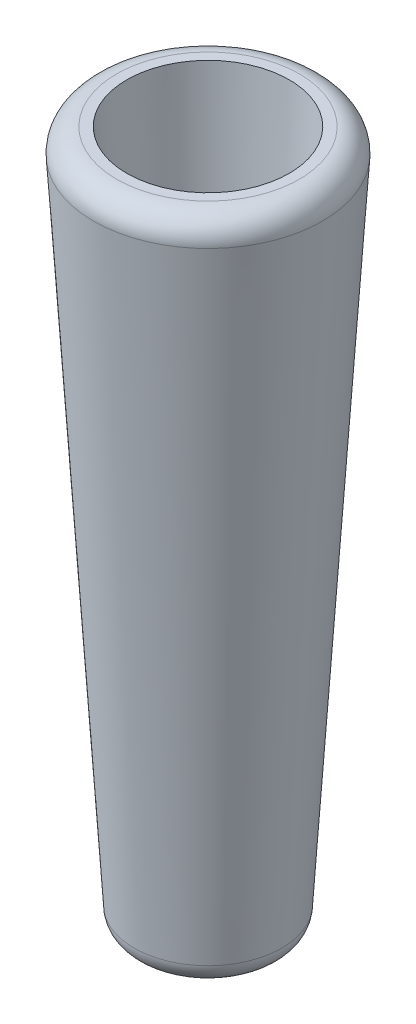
ISO-10303-21;
HEADER;
FILE_DESCRIPTION(('STEP AP214'),'2;1');
FILE_NAME('part.step','',(''),(''),'','','');
FILE_SCHEMA(('AUTOMOTIVE_DESIGN { 1 0 10303 214 1 1 1 1 }'));
ENDSEC;
DATA;
#1=APPLICATION_CONTEXT('core data for automotive mechanical design processes');
#2=APPLICATION_PROTOCOL_DEFINITION('international standard','automotive_design',2000,#1);
#3=PRODUCT_CONTEXT('',#1,'mechanical');
#4=PRODUCT('Part','Part','',(#3));
#5=PRODUCT_RELATED_PRODUCT_CATEGORY('part','',(#4));
#6=PRODUCT_DEFINITION_FORMATION('','',#4);
#7=PRODUCT_DEFINITION_CONTEXT('part definition',#1,'design');
#8=PRODUCT_DEFINITION('design','',#6,#7);
#9=PRODUCT_DEFINITION_SHAPE('','',#8);
#10=(LENGTH_UNIT() NAMED_UNIT(*) SI_UNIT(.MILLI.,.METRE.));
#11=(NAMED_UNIT(*) PLANE_ANGLE_UNIT() SI_UNIT($,.RADIAN.));
#12=(NAMED_UNIT(*) SI_UNIT($,.STERADIAN.) SOLID_ANGLE_UNIT());
#13=UNCERTAINTY_MEASURE_WITH_UNIT(LENGTH_MEASURE(1.E-05),#10,'distance_accuracy_value','');
#14=(GEOMETRIC_REPRESENTATION_CONTEXT(3) GLOBAL_UNCERTAINTY_ASSIGNED_CONTEXT((#13)) GLOBAL_UNIT_ASSIGNED_CONTEXT((#10,
#11,#12)) REPRESENTATION_CONTEXT('',''));
#15=CARTESIAN_POINT('',(0.,0.,0.));
#16=DIRECTION('',(0.,0.,1.));
#17=DIRECTION('',(1.,0.,0.));
#18=AXIS2_PLACEMENT_3D('',#15,#16,#17);
#19=CARTESIAN_POINT('',(0.,-40.,0.));
#20=DIRECTION('',(0.,1.,0.));
#21=DIRECTION('',(0.,0.,1.));
#22=AXIS2_PLACEMENT_3D('',#19,#20,#21);
#23=CONICAL_SURFACE('',#22,2.5,0.0624188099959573);
#24=CARTESIAN_POINT('',(0.,-1.06237828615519,0.));
#25=DIRECTION('',(0.,-1.,0.));
#26=DIRECTION('',(0.,0.,-1.));
#27=AXIS2_PLACEMENT_3D('',#24,#25,#26);
#28=CIRCLE('',#27,4.9336013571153);
#29=CARTESIAN_POINT('',(0.,-1.06237828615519,-4.9336013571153));
#30=VERTEX_POINT('',#29);
#31=EDGE_CURVE('E48',#30,#30,#28,.T.);
#32=ORIENTED_EDGE('',*,*,#31,.T.);
#33=EDGE_LOOP('',(#32));
#34=FACE_BOUND('',#33,.T.);
#35=CARTESIAN_POINT('',(0.,-29.0623782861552,0.));
#36=DIRECTION('',(0.,-1.,0.));
#37=DIRECTION('',(0.,0.,-1.));
#38=AXIS2_PLACEMENT_3D('',#35,#36,#37);
#39=CIRCLE('',#38,3.1836013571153);
#40=CARTESIAN_POINT('',(0.,-29.0623782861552,-3.1836013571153));
#41=VERTEX_POINT('',#40);
#42=EDGE_CURVE('E52',#41,#41,#39,.F.);
#43=ORIENTED_EDGE('',*,*,#42,.T.);
#44=EDGE_LOOP('',(#43));
#45=FACE_BOUND('',#44,.T.);
#46=ADVANCED_FACE('F37',(#34,#45),#23,.T.);
#47=CARTESIAN_POINT('',(0.,-39.9064325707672,0.));
#48=DIRECTION('',(0.,1.,0.));
#49=DIRECTION('',(0.,0.,1.));
#50=AXIS2_PLACEMENT_3D('',#47,#48,#49);
#51=CONICAL_SURFACE('',#50,1.00292113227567,0.0624188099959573);
#52=CARTESIAN_POINT('',(0.,0.,0.));
#53=DIRECTION('',(0.,1.,0.));
#54=DIRECTION('',(0.,0.,1.));
#55=AXIS2_PLACEMENT_3D('',#52,#53,#54);
#56=CIRCLE('',#55,3.49707316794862);
#57=CARTESIAN_POINT('',(0.,0.,3.49707316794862));
#58=VERTEX_POINT('',#57);
#59=EDGE_CURVE('E57',#58,#58,#56,.F.);
#60=ORIENTED_EDGE('',*,*,#59,.F.);
#61=EDGE_LOOP('',(#60));
#62=FACE_BOUND('',#61,.T.);
#63=CARTESIAN_POINT('',(0.,-30.,0.));
#64=DIRECTION('',(0.,-1.,0.));
#65=DIRECTION('',(0.,0.,-1.));
#66=AXIS2_PLACEMENT_3D('',#63,#64,#65);
#67=CIRCLE('',#66,1.62207316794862);
#68=CARTESIAN_POINT('',(0.,-30.,-1.62207316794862));
#69=VERTEX_POINT('',#68);
#70=EDGE_CURVE('E58',#69,#69,#67,.F.);
#71=ORIENTED_EDGE('',*,*,#70,.F.);
#72=EDGE_LOOP('',(#71));
#73=FACE_BOUND('',#72,.T.);
#74=ADVANCED_FACE('F66',(#62,#73),#51,.F.);
#75=CARTESIAN_POINT('',(0.,0.,0.));
#76=DIRECTION('',(0.,1.,0.));
#77=DIRECTION('',(0.,0.,1.));
#78=AXIS2_PLACEMENT_3D('',#75,#76,#77);
#79=PLANE('',#78);
#80=CARTESIAN_POINT('',(0.,0.,0.));
#81=DIRECTION('',(0.,1.,0.));
#82=DIRECTION('',(0.,0.,1.));
#83=AXIS2_PLACEMENT_3D('',#80,#81,#82);
#84=CIRCLE('',#83,3.93554877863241);
#85=CARTESIAN_POINT('',(0.,0.,3.93554877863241));
#86=VERTEX_POINT('',#85);
#87=EDGE_CURVE('E44',#86,#86,#84,.T.);
#88=ORIENTED_EDGE('',*,*,#87,.T.);
#89=EDGE_LOOP('',(#88));
#90=FACE_BOUND('',#89,.T.);
#91=ORIENTED_EDGE('',*,*,#59,.T.);
#92=EDGE_LOOP('',(#91));
#93=FACE_BOUND('',#92,.T.);
#94=ADVANCED_FACE('F64',(#90,#93),#79,.T.);
#95=CARTESIAN_POINT('',(0.,-30.,0.));
#96=DIRECTION('',(0.,-1.,0.));
#97=DIRECTION('',(0.,0.,-1.));
#98=AXIS2_PLACEMENT_3D('',#95,#96,#97);
#99=PLANE('',#98);
#100=CARTESIAN_POINT('',(0.,-30.,0.));
#101=DIRECTION('',(0.,-1.,0.));
#102=DIRECTION('',(0.,0.,-1.));
#103=AXIS2_PLACEMENT_3D('',#100,#101,#102);
#104=CIRCLE('',#103,2.18554877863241);
#105=CARTESIAN_POINT('',(0.,-30.,-2.18554877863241));
#106=VERTEX_POINT('',#105);
#107=EDGE_CURVE('E10',#106,#106,#104,.T.);
#108=ORIENTED_EDGE('',*,*,#107,.T.);
#109=EDGE_LOOP('',(#108));
#110=FACE_BOUND('',#109,.T.);
#111=ORIENTED_EDGE('',*,*,#70,.T.);
#112=EDGE_LOOP('',(#111));
#113=FACE_BOUND('',#112,.T.);
#114=ADVANCED_FACE('F72',(#110,#113),#99,.T.);
#115=CARTESIAN_POINT('',(0.,-1.,0.));
#116=DIRECTION('',(0.,1.,0.));
#117=DIRECTION('',(0.,0.,1.));
#118=AXIS2_PLACEMENT_3D('',#115,#116,#117);
#119=TOROIDAL_SURFACE('',#118,3.93554877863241,1.);
#120=ORIENTED_EDGE('',*,*,#87,.F.);
#121=EDGE_LOOP('',(#120));
#122=FACE_BOUND('',#121,.T.);
#123=ORIENTED_EDGE('',*,*,#31,.F.);
#124=EDGE_LOOP('',(#123));
#125=FACE_BOUND('',#124,.T.);
#126=ADVANCED_FACE('F74',(#122,#125),#119,.T.);
#127=CARTESIAN_POINT('',(0.,-29.,0.));
#128=DIRECTION('',(0.,-1.,0.));
#129=DIRECTION('',(0.,0.,-1.));
#130=AXIS2_PLACEMENT_3D('',#127,#128,#129);
#131=TOROIDAL_SURFACE('',#130,2.18554877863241,1.);
#132=ORIENTED_EDGE('',*,*,#107,.F.);
#133=EDGE_LOOP('',(#132));
#134=FACE_BOUND('',#133,.T.);
#135=ORIENTED_EDGE('',*,*,#42,.F.);
#136=EDGE_LOOP('',(#135));
#137=FACE_BOUND('',#136,.T.);
#138=ADVANCED_FACE('F39',(#134,#137),#131,.T.);
#139=CLOSED_SHELL('',(#46,#74,#94,#114,#126,#138));
#140=MANIFOLD_SOLID_BREP('B2',#139);
#141=ADVANCED_BREP_SHAPE_REPRESENTATION('',(#18,#140),#14);
#142=SHAPE_DEFINITION_REPRESENTATION(#9,#141);
ENDSEC;
END-ISO-10303-21;
